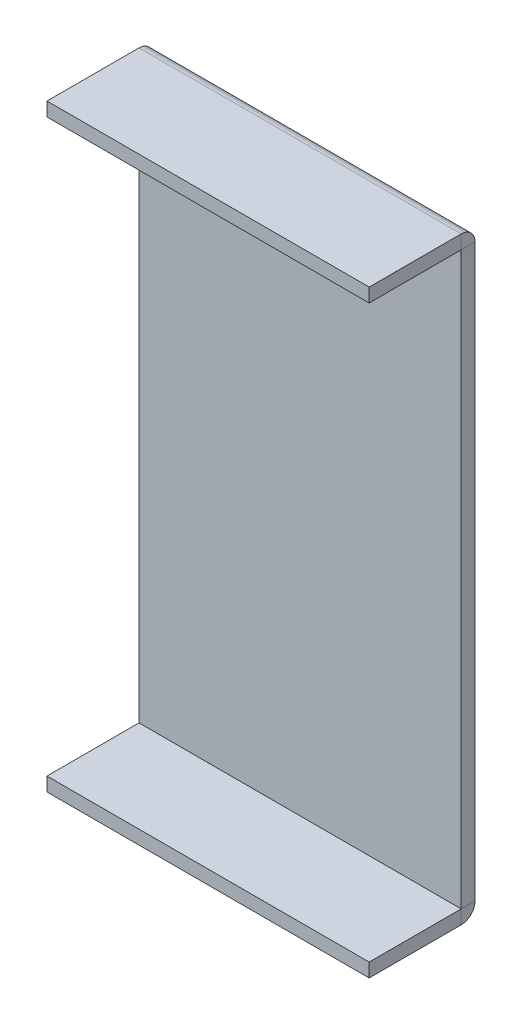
ISO-10303-21;
HEADER;
FILE_DESCRIPTION(('STEP AP214'),'2;1');
FILE_NAME('part.step','',(''),(''),'','','');
FILE_SCHEMA(('AUTOMOTIVE_DESIGN { 1 0 10303 214 1 1 1 1 }'));
ENDSEC;
DATA;
#1=APPLICATION_CONTEXT('core data for automotive mechanical design processes');
#2=APPLICATION_PROTOCOL_DEFINITION('international standard','automotive_design',2000,#1);
#3=PRODUCT_CONTEXT('',#1,'mechanical');
#4=PRODUCT('Part','Part','',(#3));
#5=PRODUCT_RELATED_PRODUCT_CATEGORY('part','',(#4));
#6=PRODUCT_DEFINITION_FORMATION('','',#4);
#7=PRODUCT_DEFINITION_CONTEXT('part definition',#1,'design');
#8=PRODUCT_DEFINITION('design','',#6,#7);
#9=PRODUCT_DEFINITION_SHAPE('','',#8);
#10=(LENGTH_UNIT() NAMED_UNIT(*) SI_UNIT(.MILLI.,.METRE.));
#11=(NAMED_UNIT(*) PLANE_ANGLE_UNIT() SI_UNIT($,.RADIAN.));
#12=(NAMED_UNIT(*) SI_UNIT($,.STERADIAN.) SOLID_ANGLE_UNIT());
#13=UNCERTAINTY_MEASURE_WITH_UNIT(LENGTH_MEASURE(1.E-05),#10,'distance_accuracy_value','');
#14=(GEOMETRIC_REPRESENTATION_CONTEXT(3) GLOBAL_UNCERTAINTY_ASSIGNED_CONTEXT((#13)) GLOBAL_UNIT_ASSIGNED_CONTEXT((#10,
#11,#12)) REPRESENTATION_CONTEXT('',''));
#15=CARTESIAN_POINT('',(0.,0.,0.));
#16=DIRECTION('',(0.,0.,1.));
#17=DIRECTION('',(1.,0.,0.));
#18=AXIS2_PLACEMENT_3D('',#15,#16,#17);
#19=CARTESIAN_POINT('',(70.,81.6021977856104,23.));
#20=DIRECTION('',(0.,0.,1.));
#21=DIRECTION('',(0.,-1.,0.));
#22=AXIS2_PLACEMENT_3D('',#19,#20,#21);
#23=PLANE('',#22);
#24=DIRECTION('',(-1.,0.,0.));
#25=VECTOR('',#24,1.);
#26=CARTESIAN_POINT('',(70.,-67.,23.));
#27=LINE('',#26,#25);
#28=CARTESIAN_POINT('',(70.,-67.,23.));
#29=VERTEX_POINT('',#28);
#30=CARTESIAN_POINT('',(0.,-67.,23.));
#31=VERTEX_POINT('',#30);
#32=EDGE_CURVE('E243',#29,#31,#27,.T.);
#33=ORIENTED_EDGE('',*,*,#32,.F.);
#34=DIRECTION('',(0.,-1.,0.));
#35=VECTOR('',#34,1.);
#36=CARTESIAN_POINT('',(70.,81.6021977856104,23.));
#37=LINE('',#36,#35);
#38=CARTESIAN_POINT('',(70.,-64.,23.));
#39=VERTEX_POINT('',#38);
#40=EDGE_CURVE('E71',#39,#29,#37,.T.);
#41=ORIENTED_EDGE('',*,*,#40,.F.);
#42=DIRECTION('',(-1.,0.,0.));
#43=VECTOR('',#42,1.);
#44=CARTESIAN_POINT('',(70.,-64.,23.));
#45=LINE('',#44,#43);
#46=CARTESIAN_POINT('',(0.,-64.,23.));
#47=VERTEX_POINT('',#46);
#48=EDGE_CURVE('E79',#39,#47,#45,.T.);
#49=ORIENTED_EDGE('',*,*,#48,.T.);
#50=DIRECTION('',(0.,-1.,0.));
#51=VECTOR('',#50,1.);
#52=CARTESIAN_POINT('',(0.,81.6021977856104,23.));
#53=LINE('',#52,#51);
#54=EDGE_CURVE('E246',#47,#31,#53,.T.);
#55=ORIENTED_EDGE('',*,*,#54,.T.);
#56=EDGE_LOOP('',(#33,#41,#49,#55));
#57=FACE_BOUND('',#56,.T.);
#58=ADVANCED_FACE('F61',(#57),#23,.T.);
#59=CARTESIAN_POINT('',(0.,81.6021977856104,23.));
#60=DIRECTION('',(1.,0.,0.));
#61=DIRECTION('',(0.,-1.,0.));
#62=AXIS2_PLACEMENT_3D('',#59,#60,#61);
#63=PLANE('',#62);
#64=DIRECTION('',(0.,-1.,0.));
#65=VECTOR('',#64,1.);
#66=CARTESIAN_POINT('',(0.,81.6021977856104,3.00000000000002));
#67=LINE('',#66,#65);
#68=CARTESIAN_POINT('',(0.,-64.,3.));
#69=VERTEX_POINT('',#68);
#70=CARTESIAN_POINT('',(0.,-67.,3.00000000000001));
#71=VERTEX_POINT('',#70);
#72=EDGE_CURVE('E168',#69,#71,#67,.T.);
#73=ORIENTED_EDGE('',*,*,#72,.T.);
#74=DIRECTION('',(0.,0.,-1.));
#75=VECTOR('',#74,1.);
#76=CARTESIAN_POINT('',(0.,-67.,23.));
#77=LINE('',#76,#75);
#78=EDGE_CURVE('E240',#31,#71,#77,.T.);
#79=ORIENTED_EDGE('',*,*,#78,.F.);
#80=ORIENTED_EDGE('',*,*,#54,.F.);
#81=DIRECTION('',(0.,0.,1.));
#82=VECTOR('',#81,1.);
#83=CARTESIAN_POINT('',(0.,-64.,23.));
#84=LINE('',#83,#82);
#85=EDGE_CURVE('E13',#69,#47,#84,.T.);
#86=ORIENTED_EDGE('',*,*,#85,.F.);
#87=EDGE_LOOP('',(#73,#79,#80,#86));
#88=FACE_BOUND('',#87,.T.);
#89=ADVANCED_FACE('F292',(#88),#63,.F.);
#90=CARTESIAN_POINT('',(70.,-67.,23.));
#91=DIRECTION('',(0.,1.,0.));
#92=DIRECTION('',(0.,0.,1.));
#93=AXIS2_PLACEMENT_3D('',#90,#91,#92);
#94=PLANE('',#93);
#95=DIRECTION('',(-1.,0.,0.));
#96=VECTOR('',#95,1.);
#97=CARTESIAN_POINT('',(70.,-67.,3.00000000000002));
#98=LINE('',#97,#96);
#99=CARTESIAN_POINT('',(70.,-67.,3.));
#100=VERTEX_POINT('',#99);
#101=EDGE_CURVE('E177',#100,#71,#98,.T.);
#102=ORIENTED_EDGE('',*,*,#101,.F.);
#103=DIRECTION('',(0.,0.,-1.));
#104=VECTOR('',#103,1.);
#105=CARTESIAN_POINT('',(70.,-67.,23.));
#106=LINE('',#105,#104);
#107=EDGE_CURVE('E237',#29,#100,#106,.T.);
#108=ORIENTED_EDGE('',*,*,#107,.F.);
#109=ORIENTED_EDGE('',*,*,#32,.T.);
#110=ORIENTED_EDGE('',*,*,#78,.T.);
#111=EDGE_LOOP('',(#102,#108,#109,#110));
#112=FACE_BOUND('',#111,.T.);
#113=ADVANCED_FACE('F298',(#112),#94,.F.);
#114=CARTESIAN_POINT('',(70.,81.6021977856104,23.));
#115=DIRECTION('',(1.,0.,0.));
#116=DIRECTION('',(0.,-1.,0.));
#117=AXIS2_PLACEMENT_3D('',#114,#115,#116);
#118=PLANE('',#117);
#119=ORIENTED_EDGE('',*,*,#107,.T.);
#120=DIRECTION('',(0.,-1.,0.));
#121=VECTOR('',#120,1.);
#122=CARTESIAN_POINT('',(70.,81.6021977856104,3.00000000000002));
#123=LINE('',#122,#121);
#124=CARTESIAN_POINT('',(70.,-64.,3.));
#125=VERTEX_POINT('',#124);
#126=EDGE_CURVE('E65',#125,#100,#123,.T.);
#127=ORIENTED_EDGE('',*,*,#126,.F.);
#128=DIRECTION('',(0.,0.,1.));
#129=VECTOR('',#128,1.);
#130=CARTESIAN_POINT('',(70.,-64.,23.));
#131=LINE('',#130,#129);
#132=EDGE_CURVE('E96',#125,#39,#131,.T.);
#133=ORIENTED_EDGE('',*,*,#132,.T.);
#134=ORIENTED_EDGE('',*,*,#40,.T.);
#135=EDGE_LOOP('',(#119,#127,#133,#134));
#136=FACE_BOUND('',#135,.T.);
#137=ADVANCED_FACE('F289',(#136),#118,.T.);
#138=CARTESIAN_POINT('',(70.,-64.,23.));
#139=DIRECTION('',(0.,-1.,0.));
#140=DIRECTION('',(0.,0.,-1.));
#141=AXIS2_PLACEMENT_3D('',#138,#139,#140);
#142=PLANE('',#141);
#143=ORIENTED_EDGE('',*,*,#85,.T.);
#144=ORIENTED_EDGE('',*,*,#48,.F.);
#145=ORIENTED_EDGE('',*,*,#132,.F.);
#146=DIRECTION('',(-1.,0.,0.));
#147=VECTOR('',#146,1.);
#148=CARTESIAN_POINT('',(70.,-64.,3.));
#149=LINE('',#148,#147);
#150=EDGE_CURVE('E100',#125,#69,#149,.T.);
#151=ORIENTED_EDGE('',*,*,#150,.T.);
#152=EDGE_LOOP('',(#143,#144,#145,#151));
#153=FACE_BOUND('',#152,.T.);
#154=ADVANCED_FACE('F63',(#153),#142,.F.);
#155=CARTESIAN_POINT('',(70.,-85.6021977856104,23.));
#156=DIRECTION('',(0.,0.,-1.));
#157=DIRECTION('',(0.,1.,0.));
#158=AXIS2_PLACEMENT_3D('',#155,#156,#157);
#159=PLANE('',#158);
#160=DIRECTION('',(0.,1.,0.));
#161=VECTOR('',#160,1.);
#162=CARTESIAN_POINT('',(70.,-85.6021977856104,23.));
#163=LINE('',#162,#161);
#164=CARTESIAN_POINT('',(70.,60.,23.));
#165=VERTEX_POINT('',#164);
#166=CARTESIAN_POINT('',(70.,63.,23.));
#167=VERTEX_POINT('',#166);
#168=EDGE_CURVE('E229',#165,#167,#163,.T.);
#169=ORIENTED_EDGE('',*,*,#168,.T.);
#170=DIRECTION('',(-1.,0.,0.));
#171=VECTOR('',#170,1.);
#172=CARTESIAN_POINT('',(70.,63.,23.));
#173=LINE('',#172,#171);
#174=CARTESIAN_POINT('',(0.,63.,23.));
#175=VERTEX_POINT('',#174);
#176=EDGE_CURVE('E124',#167,#175,#173,.T.);
#177=ORIENTED_EDGE('',*,*,#176,.T.);
#178=DIRECTION('',(0.,1.,0.));
#179=VECTOR('',#178,1.);
#180=CARTESIAN_POINT('',(0.,-85.6021977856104,23.));
#181=LINE('',#180,#179);
#182=CARTESIAN_POINT('',(0.,60.,23.));
#183=VERTEX_POINT('',#182);
#184=EDGE_CURVE('E214',#183,#175,#181,.T.);
#185=ORIENTED_EDGE('',*,*,#184,.F.);
#186=DIRECTION('',(-1.,0.,0.));
#187=VECTOR('',#186,1.);
#188=CARTESIAN_POINT('',(70.,60.,23.));
#189=LINE('',#188,#187);
#190=EDGE_CURVE('E109',#165,#183,#189,.T.);
#191=ORIENTED_EDGE('',*,*,#190,.F.);
#192=EDGE_LOOP('',(#169,#177,#185,#191));
#193=FACE_BOUND('',#192,.T.);
#194=ADVANCED_FACE('F281',(#193),#159,.F.);
#195=CARTESIAN_POINT('',(70.,-85.6021977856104,23.));
#196=DIRECTION('',(1.,0.,0.));
#197=DIRECTION('',(0.,1.,0.));
#198=AXIS2_PLACEMENT_3D('',#195,#196,#197);
#199=PLANE('',#198);
#200=DIRECTION('',(0.,0.,1.));
#201=VECTOR('',#200,1.);
#202=CARTESIAN_POINT('',(70.,63.,23.));
#203=LINE('',#202,#201);
#204=CARTESIAN_POINT('',(70.,63.,3.));
#205=VERTEX_POINT('',#204);
#206=EDGE_CURVE('E226',#205,#167,#203,.T.);
#207=ORIENTED_EDGE('',*,*,#206,.T.);
#208=ORIENTED_EDGE('',*,*,#168,.F.);
#209=DIRECTION('',(0.,0.,-1.));
#210=VECTOR('',#209,1.);
#211=CARTESIAN_POINT('',(70.,60.,23.));
#212=LINE('',#211,#210);
#213=CARTESIAN_POINT('',(70.,60.,3.));
#214=VERTEX_POINT('',#213);
#215=EDGE_CURVE('E223',#165,#214,#212,.T.);
#216=ORIENTED_EDGE('',*,*,#215,.T.);
#217=DIRECTION('',(0.,1.,0.));
#218=VECTOR('',#217,1.);
#219=CARTESIAN_POINT('',(70.,-85.6021977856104,3.00000000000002));
#220=LINE('',#219,#218);
#221=EDGE_CURVE('E220',#214,#205,#220,.T.);
#222=ORIENTED_EDGE('',*,*,#221,.T.);
#223=EDGE_LOOP('',(#207,#208,#216,#222));
#224=FACE_BOUND('',#223,.T.);
#225=ADVANCED_FACE('F269',(#224),#199,.T.);
#226=CARTESIAN_POINT('',(70.,63.,23.));
#227=DIRECTION('',(0.,-1.,0.));
#228=DIRECTION('',(0.,0.,-1.));
#229=AXIS2_PLACEMENT_3D('',#226,#227,#228);
#230=PLANE('',#229);
#231=ORIENTED_EDGE('',*,*,#206,.F.);
#232=DIRECTION('',(-1.,0.,0.));
#233=VECTOR('',#232,1.);
#234=CARTESIAN_POINT('',(70.,63.,3.00000000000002));
#235=LINE('',#234,#233);
#236=CARTESIAN_POINT('',(0.,63.,3.));
#237=VERTEX_POINT('',#236);
#238=EDGE_CURVE('E218',#205,#237,#235,.T.);
#239=ORIENTED_EDGE('',*,*,#238,.T.);
#240=DIRECTION('',(0.,0.,1.));
#241=VECTOR('',#240,1.);
#242=CARTESIAN_POINT('',(0.,63.,23.));
#243=LINE('',#242,#241);
#244=EDGE_CURVE('E128',#237,#175,#243,.T.);
#245=ORIENTED_EDGE('',*,*,#244,.T.);
#246=ORIENTED_EDGE('',*,*,#176,.F.);
#247=EDGE_LOOP('',(#231,#239,#245,#246));
#248=FACE_BOUND('',#247,.T.);
#249=ADVANCED_FACE('F266',(#248),#230,.F.);
#250=CARTESIAN_POINT('',(0.,-85.6021977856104,23.));
#251=DIRECTION('',(1.,0.,0.));
#252=DIRECTION('',(0.,1.,0.));
#253=AXIS2_PLACEMENT_3D('',#250,#251,#252);
#254=PLANE('',#253);
#255=ORIENTED_EDGE('',*,*,#184,.T.);
#256=ORIENTED_EDGE('',*,*,#244,.F.);
#257=DIRECTION('',(0.,1.,0.));
#258=VECTOR('',#257,1.);
#259=CARTESIAN_POINT('',(0.,-85.6021977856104,3.00000000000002));
#260=LINE('',#259,#258);
#261=CARTESIAN_POINT('',(0.,60.,3.));
#262=VERTEX_POINT('',#261);
#263=EDGE_CURVE('E210',#262,#237,#260,.T.);
#264=ORIENTED_EDGE('',*,*,#263,.F.);
#265=DIRECTION('',(0.,0.,-1.));
#266=VECTOR('',#265,1.);
#267=CARTESIAN_POINT('',(0.,60.,23.));
#268=LINE('',#267,#266);
#269=EDGE_CURVE('E212',#183,#262,#268,.T.);
#270=ORIENTED_EDGE('',*,*,#269,.F.);
#271=EDGE_LOOP('',(#255,#256,#264,#270));
#272=FACE_BOUND('',#271,.T.);
#273=ADVANCED_FACE('F264',(#272),#254,.F.);
#274=CARTESIAN_POINT('',(70.,60.,23.));
#275=DIRECTION('',(0.,1.,0.));
#276=DIRECTION('',(0.,0.,1.));
#277=AXIS2_PLACEMENT_3D('',#274,#275,#276);
#278=PLANE('',#277);
#279=ORIENTED_EDGE('',*,*,#269,.T.);
#280=DIRECTION('',(-1.,0.,0.));
#281=VECTOR('',#280,1.);
#282=CARTESIAN_POINT('',(70.,60.,3.));
#283=LINE('',#282,#281);
#284=EDGE_CURVE('E202',#214,#262,#283,.T.);
#285=ORIENTED_EDGE('',*,*,#284,.F.);
#286=ORIENTED_EDGE('',*,*,#215,.F.);
#287=ORIENTED_EDGE('',*,*,#190,.T.);
#288=EDGE_LOOP('',(#279,#285,#286,#287));
#289=FACE_BOUND('',#288,.T.);
#290=ADVANCED_FACE('F279',(#289),#278,.F.);
#291=CARTESIAN_POINT('',(70.,-64.,3.));
#292=DIRECTION('',(0.,0.,-1.));
#293=DIRECTION('',(0.,1.,0.));
#294=AXIS2_PLACEMENT_3D('',#291,#292,#293);
#295=PLANE('',#294);
#296=DIRECTION('',(0.,-1.,0.));
#297=VECTOR('',#296,1.);
#298=CARTESIAN_POINT('',(0.,-64.,3.));
#299=LINE('',#298,#297);
#300=EDGE_CURVE('E193',#262,#69,#299,.T.);
#301=ORIENTED_EDGE('',*,*,#300,.T.);
#302=ORIENTED_EDGE('',*,*,#150,.F.);
#303=DIRECTION('',(0.,-1.,0.));
#304=VECTOR('',#303,1.);
#305=CARTESIAN_POINT('',(70.,-64.,3.));
#306=LINE('',#305,#304);
#307=EDGE_CURVE('E199',#214,#125,#306,.T.);
#308=ORIENTED_EDGE('',*,*,#307,.F.);
#309=ORIENTED_EDGE('',*,*,#284,.T.);
#310=EDGE_LOOP('',(#301,#302,#308,#309));
#311=FACE_BOUND('',#310,.T.);
#312=ADVANCED_FACE('F275',(#311),#295,.F.);
#313=CARTESIAN_POINT('',(0.,-64.,287.787640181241));
#314=DIRECTION('',(1.,0.,0.));
#315=DIRECTION('',(0.,0.,-1.));
#316=AXIS2_PLACEMENT_3D('',#313,#314,#315);
#317=PLANE('',#316);
#318=DIRECTION('',(0.,0.,-1.));
#319=VECTOR('',#318,1.);
#320=CARTESIAN_POINT('',(0.,60.,287.787640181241));
#321=LINE('',#320,#319);
#322=CARTESIAN_POINT('',(0.,60.,0.));
#323=VERTEX_POINT('',#322);
#324=EDGE_CURVE('E184',#262,#323,#321,.T.);
#325=ORIENTED_EDGE('',*,*,#324,.T.);
#326=DIRECTION('',(0.,1.,0.));
#327=VECTOR('',#326,1.);
#328=CARTESIAN_POINT('',(0.,63.,0.));
#329=LINE('',#328,#327);
#330=CARTESIAN_POINT('',(0.,-64.,0.));
#331=VERTEX_POINT('',#330);
#332=EDGE_CURVE('E182',#331,#323,#329,.T.);
#333=ORIENTED_EDGE('',*,*,#332,.F.);
#334=DIRECTION('',(0.,0.,-1.));
#335=VECTOR('',#334,1.);
#336=CARTESIAN_POINT('',(0.,-64.,287.787640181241));
#337=LINE('',#336,#335);
#338=EDGE_CURVE('E165',#69,#331,#337,.T.);
#339=ORIENTED_EDGE('',*,*,#338,.F.);
#340=ORIENTED_EDGE('',*,*,#300,.F.);
#341=EDGE_LOOP('',(#325,#333,#339,#340));
#342=FACE_BOUND('',#341,.T.);
#343=ADVANCED_FACE('F183',(#342),#317,.F.);
#344=CARTESIAN_POINT('',(70.,-64.,287.787640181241));
#345=DIRECTION('',(1.,0.,0.));
#346=DIRECTION('',(0.,0.,-1.));
#347=AXIS2_PLACEMENT_3D('',#344,#345,#346);
#348=PLANE('',#347);
#349=DIRECTION('',(0.,1.,0.));
#350=VECTOR('',#349,1.);
#351=CARTESIAN_POINT('',(70.,63.,0.));
#352=LINE('',#351,#350);
#353=CARTESIAN_POINT('',(70.,-64.,0.));
#354=VERTEX_POINT('',#353);
#355=CARTESIAN_POINT('',(70.,60.,0.));
#356=VERTEX_POINT('',#355);
#357=EDGE_CURVE('E186',#354,#356,#352,.T.);
#358=ORIENTED_EDGE('',*,*,#357,.T.);
#359=DIRECTION('',(0.,0.,-1.));
#360=VECTOR('',#359,1.);
#361=CARTESIAN_POINT('',(70.,60.,287.787640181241));
#362=LINE('',#361,#360);
#363=EDGE_CURVE('E206',#214,#356,#362,.T.);
#364=ORIENTED_EDGE('',*,*,#363,.F.);
#365=ORIENTED_EDGE('',*,*,#307,.T.);
#366=DIRECTION('',(0.,0.,-1.));
#367=VECTOR('',#366,1.);
#368=CARTESIAN_POINT('',(70.,-64.,287.787640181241));
#369=LINE('',#368,#367);
#370=EDGE_CURVE('E173',#125,#354,#369,.T.);
#371=ORIENTED_EDGE('',*,*,#370,.T.);
#372=EDGE_LOOP('',(#358,#364,#365,#371));
#373=FACE_BOUND('',#372,.T.);
#374=ADVANCED_FACE('F278',(#373),#348,.T.);
#375=CARTESIAN_POINT('',(70.,63.,0.));
#376=DIRECTION('',(0.,0.,1.));
#377=DIRECTION('',(0.,-1.,0.));
#378=AXIS2_PLACEMENT_3D('',#375,#376,#377);
#379=PLANE('',#378);
#380=ORIENTED_EDGE('',*,*,#357,.F.);
#381=DIRECTION('',(-1.,0.,0.));
#382=VECTOR('',#381,1.);
#383=CARTESIAN_POINT('',(70.,-64.,0.));
#384=LINE('',#383,#382);
#385=EDGE_CURVE('E135',#354,#331,#384,.T.);
#386=ORIENTED_EDGE('',*,*,#385,.T.);
#387=ORIENTED_EDGE('',*,*,#332,.T.);
#388=DIRECTION('',(-1.,0.,0.));
#389=VECTOR('',#388,1.);
#390=CARTESIAN_POINT('',(70.,60.,0.));
#391=LINE('',#390,#389);
#392=EDGE_CURVE('E142',#356,#323,#391,.T.);
#393=ORIENTED_EDGE('',*,*,#392,.F.);
#394=EDGE_LOOP('',(#380,#386,#387,#393));
#395=FACE_BOUND('',#394,.T.);
#396=ADVANCED_FACE('F190',(#395),#379,.F.);
#397=CARTESIAN_POINT('',(0.,60.,3.));
#398=DIRECTION('',(-1.,0.,0.));
#399=DIRECTION('',(0.,0.,1.));
#400=AXIS2_PLACEMENT_3D('',#397,#398,#399);
#401=PLANE('',#400);
#402=ORIENTED_EDGE('',*,*,#324,.F.);
#403=ORIENTED_EDGE('',*,*,#263,.T.);
#404=CARTESIAN_POINT('',(0.,60.,3.));
#405=DIRECTION('',(-1.,0.,0.));
#406=DIRECTION('',(0.,0.,1.));
#407=AXIS2_PLACEMENT_3D('',#404,#405,#406);
#408=CIRCLE('',#407,3.);
#409=EDGE_CURVE('E187',#323,#237,#408,.F.);
#410=ORIENTED_EDGE('',*,*,#409,.F.);
#411=EDGE_LOOP('',(#402,#403,#410));
#412=FACE_BOUND('',#411,.T.);
#413=ADVANCED_FACE('F262',(#412),#401,.T.);
#414=CARTESIAN_POINT('',(70.,60.,3.));
#415=DIRECTION('',(1.,0.,0.));
#416=DIRECTION('',(0.,0.,-1.));
#417=AXIS2_PLACEMENT_3D('',#414,#415,#416);
#418=PLANE('',#417);
#419=ORIENTED_EDGE('',*,*,#221,.F.);
#420=ORIENTED_EDGE('',*,*,#363,.T.);
#421=CARTESIAN_POINT('',(70.,60.,3.));
#422=DIRECTION('',(1.,0.,0.));
#423=DIRECTION('',(0.,0.,-1.));
#424=AXIS2_PLACEMENT_3D('',#421,#422,#423);
#425=CIRCLE('',#424,3.);
#426=EDGE_CURVE('E254',#205,#356,#425,.F.);
#427=ORIENTED_EDGE('',*,*,#426,.F.);
#428=EDGE_LOOP('',(#419,#420,#427));
#429=FACE_BOUND('',#428,.T.);
#430=ADVANCED_FACE('F272',(#429),#418,.T.);
#431=CARTESIAN_POINT('',(259.433365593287,60.,3.));
#432=DIRECTION('',(-1.,0.,0.));
#433=DIRECTION('',(0.,0.,1.));
#434=AXIS2_PLACEMENT_3D('',#431,#432,#433);
#435=CYLINDRICAL_SURFACE('',#434,3.);
#436=ORIENTED_EDGE('',*,*,#426,.T.);
#437=ORIENTED_EDGE('',*,*,#392,.T.);
#438=ORIENTED_EDGE('',*,*,#409,.T.);
#439=ORIENTED_EDGE('',*,*,#238,.F.);
#440=EDGE_LOOP('',(#436,#437,#438,#439));
#441=FACE_BOUND('',#440,.T.);
#442=ADVANCED_FACE('F258',(#441),#435,.T.);
#443=CARTESIAN_POINT('',(0.,-64.,3.));
#444=DIRECTION('',(-1.,0.,0.));
#445=DIRECTION('',(0.,0.,1.));
#446=AXIS2_PLACEMENT_3D('',#443,#444,#445);
#447=PLANE('',#446);
#448=ORIENTED_EDGE('',*,*,#72,.F.);
#449=ORIENTED_EDGE('',*,*,#338,.T.);
#450=CARTESIAN_POINT('',(0.,-64.,3.));
#451=DIRECTION('',(-1.,0.,0.));
#452=DIRECTION('',(0.,0.,1.));
#453=AXIS2_PLACEMENT_3D('',#450,#451,#452);
#454=CIRCLE('',#453,3.);
#455=EDGE_CURVE('E167',#71,#331,#454,.F.);
#456=ORIENTED_EDGE('',*,*,#455,.F.);
#457=EDGE_LOOP('',(#448,#449,#456));
#458=FACE_BOUND('',#457,.T.);
#459=ADVANCED_FACE('F166',(#458),#447,.T.);
#460=CARTESIAN_POINT('',(70.,-64.,3.));
#461=DIRECTION('',(1.,0.,0.));
#462=DIRECTION('',(0.,0.,-1.));
#463=AXIS2_PLACEMENT_3D('',#460,#461,#462);
#464=PLANE('',#463);
#465=ORIENTED_EDGE('',*,*,#370,.F.);
#466=ORIENTED_EDGE('',*,*,#126,.T.);
#467=CARTESIAN_POINT('',(70.,-64.,3.));
#468=DIRECTION('',(1.,0.,0.));
#469=DIRECTION('',(0.,0.,-1.));
#470=AXIS2_PLACEMENT_3D('',#467,#468,#469);
#471=CIRCLE('',#470,3.);
#472=EDGE_CURVE('E178',#354,#100,#471,.F.);
#473=ORIENTED_EDGE('',*,*,#472,.F.);
#474=EDGE_LOOP('',(#465,#466,#473));
#475=FACE_BOUND('',#474,.T.);
#476=ADVANCED_FACE('F252',(#475),#464,.T.);
#477=CARTESIAN_POINT('',(-169.817549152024,-64.,3.));
#478=DIRECTION('',(1.,0.,0.));
#479=DIRECTION('',(0.,0.,-1.));
#480=AXIS2_PLACEMENT_3D('',#477,#478,#479);
#481=CYLINDRICAL_SURFACE('',#480,3.);
#482=ORIENTED_EDGE('',*,*,#385,.F.);
#483=ORIENTED_EDGE('',*,*,#472,.T.);
#484=ORIENTED_EDGE('',*,*,#101,.T.);
#485=ORIENTED_EDGE('',*,*,#455,.T.);
#486=EDGE_LOOP('',(#482,#483,#484,#485));
#487=FACE_BOUND('',#486,.T.);
#488=ADVANCED_FACE('F176',(#487),#481,.T.);
#489=CLOSED_SHELL('',(#58,#89,#113,#137,#154,#194,#225,#249,#273,#290,#312,#343,#374,#396,#413,
#430,#442,#459,#476,#488));
#490=MANIFOLD_SOLID_BREP('B2',#489);
#491=ADVANCED_BREP_SHAPE_REPRESENTATION('',(#18,#490),#14);
#492=SHAPE_DEFINITION_REPRESENTATION(#9,#491);
ENDSEC;
END-ISO-10303-21;
